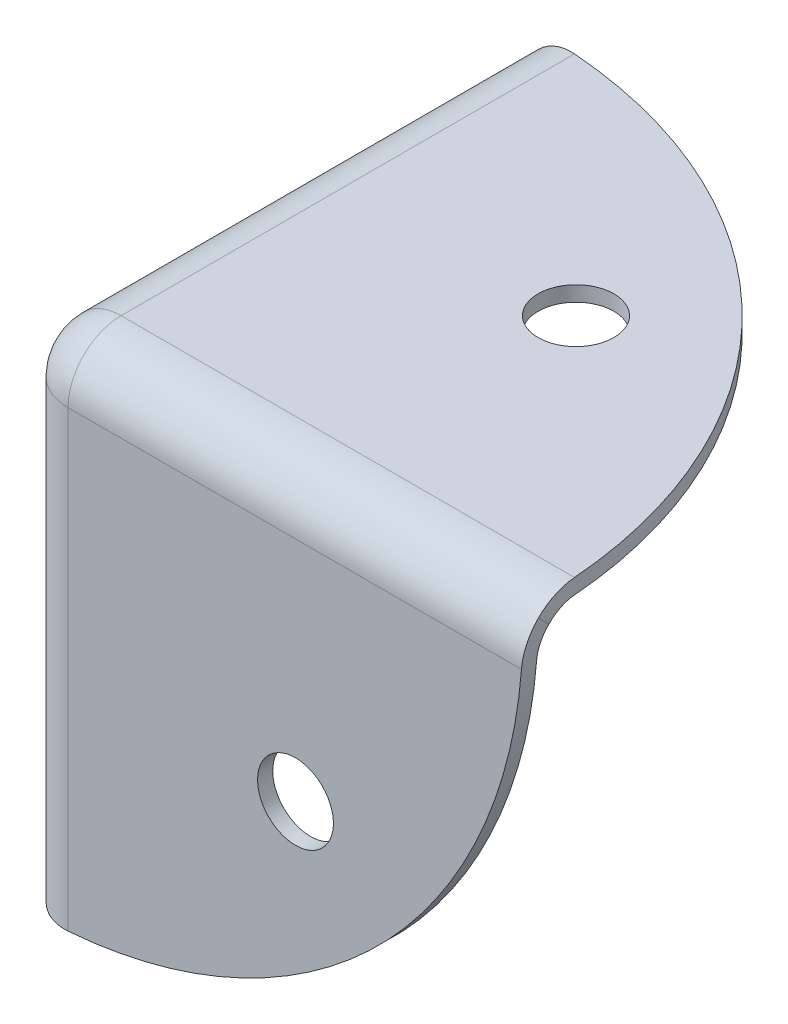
ISO-10303-21;
HEADER;
FILE_DESCRIPTION(('STEP AP214'),'2;1');
FILE_NAME('part.step','',(''),(''),'','','');
FILE_SCHEMA(('AUTOMOTIVE_DESIGN { 1 0 10303 214 1 1 1 1 }'));
ENDSEC;
DATA;
#1=APPLICATION_CONTEXT('core data for automotive mechanical design processes');
#2=APPLICATION_PROTOCOL_DEFINITION('international standard','automotive_design',2000,#1);
#3=PRODUCT_CONTEXT('',#1,'mechanical');
#4=PRODUCT('Part','Part','',(#3));
#5=PRODUCT_RELATED_PRODUCT_CATEGORY('part','',(#4));
#6=PRODUCT_DEFINITION_FORMATION('','',#4);
#7=PRODUCT_DEFINITION_CONTEXT('part definition',#1,'design');
#8=PRODUCT_DEFINITION('design','',#6,#7);
#9=PRODUCT_DEFINITION_SHAPE('','',#8);
#10=(LENGTH_UNIT() NAMED_UNIT(*) SI_UNIT(.MILLI.,.METRE.));
#11=(NAMED_UNIT(*) PLANE_ANGLE_UNIT() SI_UNIT($,.RADIAN.));
#12=(NAMED_UNIT(*) SI_UNIT($,.STERADIAN.) SOLID_ANGLE_UNIT());
#13=UNCERTAINTY_MEASURE_WITH_UNIT(LENGTH_MEASURE(1.E-05),#10,'distance_accuracy_value','');
#14=(GEOMETRIC_REPRESENTATION_CONTEXT(3) GLOBAL_UNCERTAINTY_ASSIGNED_CONTEXT((#13)) GLOBAL_UNIT_ASSIGNED_CONTEXT((#10,
#11,#12)) REPRESENTATION_CONTEXT('',''));
#15=CARTESIAN_POINT('',(0.,0.,0.));
#16=DIRECTION('',(0.,0.,1.));
#17=DIRECTION('',(1.,0.,0.));
#18=AXIS2_PLACEMENT_3D('',#15,#16,#17);
#19=CARTESIAN_POINT('',(0.,0.8,0.));
#20=DIRECTION('',(0.,1.,0.));
#21=DIRECTION('',(0.,0.,1.));
#22=AXIS2_PLACEMENT_3D('',#19,#20,#21);
#23=PLANE('',#22);
#24=DIRECTION('',(0.,0.,1.));
#25=VECTOR('',#24,1.);
#26=CARTESIAN_POINT('',(2.,0.8,0.8));
#27=LINE('',#26,#25);
#28=CARTESIAN_POINT('',(2.,0.8,-25.9229627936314));
#29=VERTEX_POINT('',#28);
#30=CARTESIAN_POINT('',(2.,0.8,-2.));
#31=VERTEX_POINT('',#30);
#32=EDGE_CURVE('E52',#29,#31,#27,.T.);
#33=ORIENTED_EDGE('',*,*,#32,.T.);
#34=DIRECTION('',(1.,0.,0.));
#35=VECTOR('',#34,1.);
#36=CARTESIAN_POINT('',(26.,0.8,-2.));
#37=LINE('',#36,#35);
#38=CARTESIAN_POINT('',(25.9229627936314,0.8,-2.));
#39=VERTEX_POINT('',#38);
#40=EDGE_CURVE('E234',#31,#39,#37,.T.);
#41=ORIENTED_EDGE('',*,*,#40,.T.);
#42=CARTESIAN_POINT('',(0.,0.8,0.));
#43=DIRECTION('',(0.,1.,0.));
#44=DIRECTION('',(0.,0.,1.));
#45=AXIS2_PLACEMENT_3D('',#42,#43,#44);
#46=CIRCLE('',#45,26.);
#47=EDGE_CURVE('E147',#39,#29,#46,.T.);
#48=ORIENTED_EDGE('',*,*,#47,.T.);
#49=EDGE_LOOP('',(#33,#41,#48));
#50=FACE_BOUND('',#49,.T.);
#51=CARTESIAN_POINT('',(14.,0.8,-14.));
#52=DIRECTION('',(0.,1.,0.));
#53=DIRECTION('',(0.,0.,1.));
#54=AXIS2_PLACEMENT_3D('',#51,#52,#53);
#55=CIRCLE('',#54,2.);
#56=CARTESIAN_POINT('',(14.,0.8,-16.));
#57=VERTEX_POINT('',#56);
#58=EDGE_CURVE('E148',#57,#57,#55,.T.);
#59=ORIENTED_EDGE('',*,*,#58,.F.);
#60=EDGE_LOOP('',(#59));
#61=FACE_BOUND('',#60,.T.);
#62=ADVANCED_FACE('F34',(#50,#61),#23,.T.);
#63=CARTESIAN_POINT('',(0.,0.,0.));
#64=DIRECTION('',(0.,1.,0.));
#65=DIRECTION('',(0.,0.,1.));
#66=AXIS2_PLACEMENT_3D('',#63,#64,#65);
#67=PLANE('',#66);
#68=CARTESIAN_POINT('',(0.,0.,0.));
#69=DIRECTION('',(0.,1.,0.));
#70=DIRECTION('',(0.,0.,1.));
#71=AXIS2_PLACEMENT_3D('',#68,#69,#70);
#72=CIRCLE('',#71,26.);
#73=CARTESIAN_POINT('',(25.9229627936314,0.,-2.));
#74=VERTEX_POINT('',#73);
#75=CARTESIAN_POINT('',(2.,0.,-25.9229627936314));
#76=VERTEX_POINT('',#75);
#77=EDGE_CURVE('E129',#74,#76,#72,.T.);
#78=ORIENTED_EDGE('',*,*,#77,.F.);
#79=DIRECTION('',(-1.,0.,0.));
#80=VECTOR('',#79,1.);
#81=CARTESIAN_POINT('',(0.,0.,-2.));
#82=LINE('',#81,#80);
#83=CARTESIAN_POINT('',(2.,0.,-2.));
#84=VERTEX_POINT('',#83);
#85=EDGE_CURVE('E144',#74,#84,#82,.T.);
#86=ORIENTED_EDGE('',*,*,#85,.T.);
#87=DIRECTION('',(0.,0.,1.));
#88=VECTOR('',#87,1.);
#89=CARTESIAN_POINT('',(2.,0.,0.));
#90=LINE('',#89,#88);
#91=EDGE_CURVE('E146',#84,#76,#90,.F.);
#92=ORIENTED_EDGE('',*,*,#91,.T.);
#93=EDGE_LOOP('',(#78,#86,#92));
#94=FACE_BOUND('',#93,.T.);
#95=CARTESIAN_POINT('',(14.,0.,-14.));
#96=DIRECTION('',(0.,1.,0.));
#97=DIRECTION('',(0.,0.,1.));
#98=AXIS2_PLACEMENT_3D('',#95,#96,#97);
#99=CIRCLE('',#98,2.);
#100=CARTESIAN_POINT('',(14.,0.,-16.));
#101=VERTEX_POINT('',#100);
#102=EDGE_CURVE('E329',#101,#101,#99,.T.);
#103=ORIENTED_EDGE('',*,*,#102,.T.);
#104=EDGE_LOOP('',(#103));
#105=FACE_BOUND('',#104,.T.);
#106=ADVANCED_FACE('F142',(#94,#105),#67,.F.);
#107=CARTESIAN_POINT('',(-0.8,0.8,0.8));
#108=DIRECTION('',(1.,0.,0.));
#109=DIRECTION('',(0.,0.,-1.));
#110=AXIS2_PLACEMENT_3D('',#107,#108,#109);
#111=PLANE('',#110);
#112=CARTESIAN_POINT('',(-0.800000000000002,0.,0.));
#113=DIRECTION('',(1.,0.,0.));
#114=DIRECTION('',(0.,0.,-1.));
#115=AXIS2_PLACEMENT_3D('',#112,#113,#114);
#116=CIRCLE('',#115,26.);
#117=CARTESIAN_POINT('',(-0.800000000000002,-2.,-25.9229627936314));
#118=VERTEX_POINT('',#117);
#119=CARTESIAN_POINT('',(-0.800000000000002,-25.9229627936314,-2.));
#120=VERTEX_POINT('',#119);
#121=EDGE_CURVE('E324',#118,#120,#116,.F.);
#122=ORIENTED_EDGE('',*,*,#121,.T.);
#123=DIRECTION('',(0.,-1.,0.));
#124=VECTOR('',#123,1.);
#125=CARTESIAN_POINT('',(-0.8,0.8,-2.));
#126=LINE('',#125,#124);
#127=CARTESIAN_POINT('',(-0.8,-2.,-2.));
#128=VERTEX_POINT('',#127);
#129=EDGE_CURVE('E341',#120,#128,#126,.F.);
#130=ORIENTED_EDGE('',*,*,#129,.T.);
#131=DIRECTION('',(0.,0.,1.));
#132=VECTOR('',#131,1.);
#133=CARTESIAN_POINT('',(-0.8,-2.,-26.));
#134=LINE('',#133,#132);
#135=EDGE_CURVE('E277',#128,#118,#134,.F.);
#136=ORIENTED_EDGE('',*,*,#135,.T.);
#137=EDGE_LOOP('',(#122,#130,#136));
#138=FACE_BOUND('',#137,.T.);
#139=CARTESIAN_POINT('',(-0.800000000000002,-14.,-14.));
#140=DIRECTION('',(1.,0.,0.));
#141=DIRECTION('',(0.,0.,-1.));
#142=AXIS2_PLACEMENT_3D('',#139,#140,#141);
#143=CIRCLE('',#142,2.);
#144=CARTESIAN_POINT('',(-0.800000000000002,-14.,-16.));
#145=VERTEX_POINT('',#144);
#146=EDGE_CURVE('E318',#145,#145,#143,.F.);
#147=ORIENTED_EDGE('',*,*,#146,.F.);
#148=EDGE_LOOP('',(#147));
#149=FACE_BOUND('',#148,.T.);
#150=ADVANCED_FACE('F185',(#138,#149),#111,.F.);
#151=CARTESIAN_POINT('',(-0.8,0.8,0.8));
#152=DIRECTION('',(0.,0.,-1.));
#153=DIRECTION('',(-1.,0.,0.));
#154=AXIS2_PLACEMENT_3D('',#151,#152,#153);
#155=PLANE('',#154);
#156=DIRECTION('',(1.,0.,0.));
#157=VECTOR('',#156,1.);
#158=CARTESIAN_POINT('',(-0.8,-2.,0.8));
#159=LINE('',#158,#157);
#160=CARTESIAN_POINT('',(25.9229627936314,-2.,0.800000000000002));
#161=VERTEX_POINT('',#160);
#162=CARTESIAN_POINT('',(2.,-2.,0.8));
#163=VERTEX_POINT('',#162);
#164=EDGE_CURVE('E365',#161,#163,#159,.F.);
#165=ORIENTED_EDGE('',*,*,#164,.T.);
#166=DIRECTION('',(0.,-1.,0.));
#167=VECTOR('',#166,1.);
#168=CARTESIAN_POINT('',(2.,0.8,0.8));
#169=LINE('',#168,#167);
#170=CARTESIAN_POINT('',(2.,-25.9229627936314,0.800000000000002));
#171=VERTEX_POINT('',#170);
#172=EDGE_CURVE('E256',#163,#171,#169,.T.);
#173=ORIENTED_EDGE('',*,*,#172,.T.);
#174=CARTESIAN_POINT('',(0.,0.,0.800000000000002));
#175=DIRECTION('',(0.,0.,-1.));
#176=DIRECTION('',(-1.,0.,0.));
#177=AXIS2_PLACEMENT_3D('',#174,#175,#176);
#178=CIRCLE('',#177,26.);
#179=EDGE_CURVE('E317',#161,#171,#178,.T.);
#180=ORIENTED_EDGE('',*,*,#179,.F.);
#181=EDGE_LOOP('',(#165,#173,#180));
#182=FACE_BOUND('',#181,.T.);
#183=CARTESIAN_POINT('',(14.,-14.,0.800000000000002));
#184=DIRECTION('',(0.,0.,-1.));
#185=DIRECTION('',(-1.,0.,0.));
#186=AXIS2_PLACEMENT_3D('',#183,#184,#185);
#187=CIRCLE('',#186,2.);
#188=CARTESIAN_POINT('',(12.,-14.,0.800000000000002));
#189=VERTEX_POINT('',#188);
#190=EDGE_CURVE('E313',#189,#189,#187,.T.);
#191=ORIENTED_EDGE('',*,*,#190,.T.);
#192=EDGE_LOOP('',(#191));
#193=FACE_BOUND('',#192,.T.);
#194=ADVANCED_FACE('F224',(#182,#193),#155,.F.);
#195=CARTESIAN_POINT('',(0.,0.8,0.));
#196=DIRECTION('',(0.,-1.,0.));
#197=DIRECTION('',(0.,0.,-1.));
#198=AXIS2_PLACEMENT_3D('',#195,#196,#197);
#199=CYLINDRICAL_SURFACE('',#198,26.);
#200=ORIENTED_EDGE('',*,*,#47,.F.);
#201=CARTESIAN_POINT('',(25.9229627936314,0.8,-2.));
#202=CARTESIAN_POINT('',(25.9289998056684,0.800007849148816,-1.92179588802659));
#203=CARTESIAN_POINT('',(25.934675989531,0.79672369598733,-1.84356634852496));
#204=CARTESIAN_POINT('',(25.9452895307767,0.783616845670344,-1.68760592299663));
#205=CARTESIAN_POINT('',(25.9502268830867,0.773794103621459,-1.60987504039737));
#206=CARTESIAN_POINT('',(25.9593483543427,0.747647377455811,-1.4554143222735));
#207=CARTESIAN_POINT('',(25.9635320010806,0.731319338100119,-1.3786851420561));
#208=CARTESIAN_POINT('',(25.9711497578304,0.692284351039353,-1.22685330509));
#209=CARTESIAN_POINT('',(25.9745839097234,0.669577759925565,-1.15175055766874));
#210=CARTESIAN_POINT('',(25.9837982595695,0.592057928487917,-0.929577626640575));
#211=CARTESIAN_POINT('',(25.9884912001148,0.527842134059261,-0.785628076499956));
#212=CARTESIAN_POINT('',(25.9953466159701,0.376283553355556,-0.510753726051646));
#213=CARTESIAN_POINT('',(25.9975141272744,0.288987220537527,-0.379803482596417));
#214=CARTESIAN_POINT('',(25.9991388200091,0.158479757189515,-0.215681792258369));
#215=CARTESIAN_POINT('',(25.9994404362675,0.124298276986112,-0.17512344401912));
#216=CARTESIAN_POINT('',(25.999852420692,0.0537340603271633,-0.0960636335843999));
#217=CARTESIAN_POINT('',(25.9999630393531,0.0173542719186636,-0.0575595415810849));
#218=CARTESIAN_POINT('',(25.9999922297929,-0.0201010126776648,-0.0201010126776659));
#219=B_SPLINE_CURVE_WITH_KNOTS('',3,(#201,#202,#203,#204,#205,#206,#207,#208,#209,#210,#211,
#212,#213,#214,#215,#216,#217,#218),.UNSPECIFIED.,.F.,.F.,(4,2,2,2,2,2,2,2,4),(0.,
0.235236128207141,0.470473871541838,0.705858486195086,0.941229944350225,1.41192869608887,
1.88168720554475,2.04074858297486,2.19960119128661),.UNSPECIFIED.);
#220=CARTESIAN_POINT('',(25.9999922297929,-0.0201010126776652,-0.0201010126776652));
#221=VERTEX_POINT('',#220);
#222=EDGE_CURVE('E12',#39,#221,#219,.T.);
#223=ORIENTED_EDGE('',*,*,#222,.T.);
#224=CARTESIAN_POINT('',(0.,0.,0.));
#225=DIRECTION('',(0.,-0.707106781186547,0.707106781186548));
#226=DIRECTION('',(0.,-0.707106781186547,-0.707106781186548));
#227=AXIS2_PLACEMENT_3D('',#224,#225,#226);
#228=ELLIPSE('',#227,36.7695526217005,26.);
#229=CARTESIAN_POINT('',(25.9934002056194,-0.585786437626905,-0.585786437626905));
#230=VERTEX_POINT('',#229);
#231=EDGE_CURVE('E132',#221,#230,#228,.F.);
#232=ORIENTED_EDGE('',*,*,#231,.T.);
#233=CARTESIAN_POINT('',(25.9934002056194,-0.585786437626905,-0.585786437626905));
#234=CARTESIAN_POINT('',(25.9925055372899,-0.546089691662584,-0.625484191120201));
#235=CARTESIAN_POINT('',(25.9914826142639,-0.508085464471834,-0.666832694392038));
#236=CARTESIAN_POINT('',(25.9891416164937,-0.435688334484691,-0.752570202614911));
#237=CARTESIAN_POINT('',(25.9878235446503,-0.401295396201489,-0.796959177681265));
#238=CARTESIAN_POINT('',(25.9833695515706,-0.303892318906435,-0.934267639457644));
#239=CARTESIAN_POINT('',(25.9797333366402,-0.246632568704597,-1.0313540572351));
#240=CARTESIAN_POINT('',(25.9709121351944,-0.149212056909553,-1.23369231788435));
#241=CARTESIAN_POINT('',(25.9657260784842,-0.109063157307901,-1.33894976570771));
#242=CARTESIAN_POINT('',(25.9537114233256,-0.0470415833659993,-1.55449278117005));
#243=CARTESIAN_POINT('',(25.9468861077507,-0.0251327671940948,-1.66476794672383));
#244=CARTESIAN_POINT('',(25.9367296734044,-0.00839377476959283,-1.8131370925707));
#245=CARTESIAN_POINT('',(25.9340925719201,-0.00524468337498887,-1.85047402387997));
#246=CARTESIAN_POINT('',(25.9286518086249,-0.00105030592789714,-1.92520410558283));
#247=CARTESIAN_POINT('',(25.9258483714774,-2.24581737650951E-06,-1.96259711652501));
#248=CARTESIAN_POINT('',(25.9229627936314,0.,-2.));
#249=B_SPLINE_CURVE_WITH_KNOTS('',3,(#233,#234,#235,#236,#237,#238,#239,#240,#241,#242,#243,
#244,#245,#246,#247,#248),.UNSPECIFIED.,.F.,.F.,(4,2,2,2,2,2,2,4),(0.,0.168337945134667,
0.336674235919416,0.673240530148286,1.01003976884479,1.34617005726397,1.45881386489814,
1.57130884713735),.UNSPECIFIED.);
#250=EDGE_CURVE('E125',#230,#74,#249,.T.);
#251=ORIENTED_EDGE('',*,*,#250,.T.);
#252=ORIENTED_EDGE('',*,*,#77,.T.);
#253=CARTESIAN_POINT('',(2.,0.,-25.9229627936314));
#254=CARTESIAN_POINT('',(1.94395472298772,-7.9071376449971E-07,-25.927287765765));
#255=CARTESIAN_POINT('',(1.88792228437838,-0.00235749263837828,-25.9314266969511));
#256=CARTESIAN_POINT('',(1.77622533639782,-0.0117670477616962,-25.9393167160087));
#257=CARTESIAN_POINT('',(1.72056083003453,-0.01881993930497,-25.9430678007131));
#258=CARTESIAN_POINT('',(1.55465309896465,-0.0469960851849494,-25.9537143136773));
#259=CARTESIAN_POINT('',(1.44547604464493,-0.0751368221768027,-25.9600045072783));
#260=CARTESIAN_POINT('',(1.23330511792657,-0.149365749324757,-25.9709509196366));
#261=CARTESIAN_POINT('',(1.13031609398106,-0.195467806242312,-25.9756058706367));
#262=CARTESIAN_POINT('',(0.933631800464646,-0.304288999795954,-25.9834175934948));
#263=CARTESIAN_POINT('',(0.839917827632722,-0.366973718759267,-25.9865774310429));
#264=CARTESIAN_POINT('',(0.723098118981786,-0.460221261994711,-25.9899593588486));
#265=CARTESIAN_POINT('',(0.694639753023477,-0.484273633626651,-25.9907339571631));
#266=CARTESIAN_POINT('',(0.639144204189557,-0.533899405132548,-25.9921576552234));
#267=CARTESIAN_POINT('',(0.612105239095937,-0.559470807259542,-25.9928069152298));
#268=CARTESIAN_POINT('',(0.585786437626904,-0.585786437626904,-25.9934002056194));
#269=B_SPLINE_CURVE_WITH_KNOTS('',3,(#253,#254,#255,#256,#257,#258,#259,#260,#261,#262,#263,
#264,#265,#266,#267,#268),.UNSPECIFIED.,.F.,.F.,(4,2,2,2,2,2,2,4),(0.,0.168531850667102,
0.337065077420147,0.674073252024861,1.01134212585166,1.34791640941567,1.45968220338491,
1.57130413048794),.UNSPECIFIED.);
#270=CARTESIAN_POINT('',(0.585786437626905,-0.585786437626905,-25.9934002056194));
#271=VERTEX_POINT('',#270);
#272=EDGE_CURVE('E210',#76,#271,#269,.T.);
#273=ORIENTED_EDGE('',*,*,#272,.T.);
#274=CARTESIAN_POINT('',(0.,0.,0.));
#275=DIRECTION('',(-0.707106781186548,-0.707106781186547,0.));
#276=DIRECTION('',(0.707106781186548,-0.707106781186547,0.));
#277=AXIS2_PLACEMENT_3D('',#274,#275,#276);
#278=ELLIPSE('',#277,36.7695526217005,26.);
#279=CARTESIAN_POINT('',(0.020101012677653,-0.020101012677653,-25.9999922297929));
#280=VERTEX_POINT('',#279);
#281=EDGE_CURVE('E366',#280,#271,#278,.T.);
#282=ORIENTED_EDGE('',*,*,#281,.F.);
#283=CARTESIAN_POINT('',(0.0201010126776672,-0.0201010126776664,-25.9999922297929));
#284=CARTESIAN_POINT('',(0.0755566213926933,0.0353655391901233,-25.9999502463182));
#285=CARTESIAN_POINT('',(0.133351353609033,0.0884887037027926,-25.9997273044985));
#286=CARTESIAN_POINT('',(0.253189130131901,0.18970137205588,-25.9988360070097));
#287=CARTESIAN_POINT('',(0.315232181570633,0.237790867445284,-25.9981676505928));
#288=CARTESIAN_POINT('',(0.443177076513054,0.328617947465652,-25.9963014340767));
#289=CARTESIAN_POINT('',(0.509081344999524,0.371352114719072,-25.9951032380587));
#290=CARTESIAN_POINT('',(0.644212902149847,0.45112301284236,-25.9921058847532));
#291=CARTESIAN_POINT('',(0.713440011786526,0.48816005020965,-25.9903067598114));
#292=CARTESIAN_POINT('',(0.925485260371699,0.590367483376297,-25.9839064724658));
#293=CARTESIAN_POINT('',(1.0726808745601,0.646643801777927,-25.9783022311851));
#294=CARTESIAN_POINT('',(1.37400742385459,0.733618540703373,-25.9641054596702));
#295=CARTESIAN_POINT('',(1.52812391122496,0.764367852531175,-25.9555189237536));
#296=CARTESIAN_POINT('',(1.73604519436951,0.788035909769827,-25.9420307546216));
#297=CARTESIAN_POINT('',(1.78878853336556,0.792524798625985,-25.938447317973));
#298=CARTESIAN_POINT('',(1.89435187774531,0.798503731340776,-25.9309509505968));
#299=CARTESIAN_POINT('',(1.94717169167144,0.799997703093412,-25.9270384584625));
#300=CARTESIAN_POINT('',(2.,0.800000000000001,-25.9229627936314));
#301=B_SPLINE_CURVE_WITH_KNOTS('',3,(#283,#284,#285,#286,#287,#288,#289,#290,#291,#292,#293,
#294,#295,#296,#297,#298,#299,#300),.UNSPECIFIED.,.F.,.F.,(4,2,2,2,2,2,2,2,4),(0.,
0.235226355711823,0.470453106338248,0.705829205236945,0.941192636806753,1.41187030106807,
1.88160734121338,2.04070858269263,2.19960102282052),.UNSPECIFIED.);
#302=EDGE_CURVE('E44',#280,#29,#301,.T.);
#303=ORIENTED_EDGE('',*,*,#302,.T.);
#304=EDGE_LOOP('',(#200,#223,#232,#251,#252,#273,#282,#303));
#305=FACE_BOUND('',#304,.T.);
#306=ADVANCED_FACE('F127',(#305),#199,.T.);
#307=CARTESIAN_POINT('',(14.,0.8,-14.));
#308=DIRECTION('',(0.,-1.,0.));
#309=DIRECTION('',(0.,0.,-1.));
#310=AXIS2_PLACEMENT_3D('',#307,#308,#309);
#311=CYLINDRICAL_SURFACE('',#310,2.);
#312=CARTESIAN_POINT('',(14.,0.8,-16.));
#313=CARTESIAN_POINT('',(14.,0.791666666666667,-16.));
#314=CARTESIAN_POINT('',(14.,0.783333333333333,-16.));
#315=CARTESIAN_POINT('',(14.,0.766666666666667,-16.));
#316=CARTESIAN_POINT('',(14.,0.758333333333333,-16.));
#317=CARTESIAN_POINT('',(14.,0.741666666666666,-16.));
#318=CARTESIAN_POINT('',(14.,0.733333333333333,-16.));
#319=CARTESIAN_POINT('',(14.,0.716666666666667,-16.));
#320=CARTESIAN_POINT('',(14.,0.708333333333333,-16.));
#321=CARTESIAN_POINT('',(14.,0.691666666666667,-16.));
#322=CARTESIAN_POINT('',(14.,0.683333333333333,-16.));
#323=CARTESIAN_POINT('',(14.,0.666666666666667,-16.));
#324=CARTESIAN_POINT('',(14.,0.658333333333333,-16.));
#325=CARTESIAN_POINT('',(14.,0.641666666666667,-16.));
#326=CARTESIAN_POINT('',(14.,0.633333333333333,-16.));
#327=CARTESIAN_POINT('',(14.,0.616666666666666,-16.));
#328=CARTESIAN_POINT('',(14.,0.608333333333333,-16.));
#329=CARTESIAN_POINT('',(14.,0.591666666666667,-16.));
#330=CARTESIAN_POINT('',(14.,0.583333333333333,-16.));
#331=CARTESIAN_POINT('',(14.,0.566666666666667,-16.));
#332=CARTESIAN_POINT('',(14.,0.558333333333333,-16.));
#333=CARTESIAN_POINT('',(14.,0.541666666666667,-16.));
#334=CARTESIAN_POINT('',(14.,0.533333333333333,-16.));
#335=CARTESIAN_POINT('',(14.,0.516666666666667,-16.));
#336=CARTESIAN_POINT('',(14.,0.508333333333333,-16.));
#337=CARTESIAN_POINT('',(14.,0.491666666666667,-16.));
#338=CARTESIAN_POINT('',(14.,0.483333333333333,-16.));
#339=CARTESIAN_POINT('',(14.,0.466666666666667,-16.));
#340=CARTESIAN_POINT('',(14.,0.458333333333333,-16.));
#341=CARTESIAN_POINT('',(14.,0.441666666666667,-16.));
#342=CARTESIAN_POINT('',(14.,0.433333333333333,-16.));
#343=CARTESIAN_POINT('',(14.,0.416666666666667,-16.));
#344=CARTESIAN_POINT('',(14.,0.408333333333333,-16.));
#345=CARTESIAN_POINT('',(14.,0.391666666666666,-16.));
#346=CARTESIAN_POINT('',(14.,0.383333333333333,-16.));
#347=CARTESIAN_POINT('',(14.,0.366666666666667,-16.));
#348=CARTESIAN_POINT('',(14.,0.358333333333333,-16.));
#349=CARTESIAN_POINT('',(14.,0.341666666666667,-16.));
#350=CARTESIAN_POINT('',(14.,0.333333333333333,-16.));
#351=CARTESIAN_POINT('',(14.,0.316666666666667,-16.));
#352=CARTESIAN_POINT('',(14.,0.308333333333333,-16.));
#353=CARTESIAN_POINT('',(14.,0.291666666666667,-16.));
#354=CARTESIAN_POINT('',(14.,0.283333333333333,-16.));
#355=CARTESIAN_POINT('',(14.,0.266666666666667,-16.));
#356=CARTESIAN_POINT('',(14.,0.258333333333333,-16.));
#357=CARTESIAN_POINT('',(14.,0.241666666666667,-16.));
#358=CARTESIAN_POINT('',(14.,0.233333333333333,-16.));
#359=CARTESIAN_POINT('',(14.,0.216666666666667,-16.));
#360=CARTESIAN_POINT('',(14.,0.208333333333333,-16.));
#361=CARTESIAN_POINT('',(14.,0.191666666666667,-16.));
#362=CARTESIAN_POINT('',(14.,0.183333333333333,-16.));
#363=CARTESIAN_POINT('',(14.,0.166666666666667,-16.));
#364=CARTESIAN_POINT('',(14.,0.158333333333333,-16.));
#365=CARTESIAN_POINT('',(14.,0.141666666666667,-16.));
#366=CARTESIAN_POINT('',(14.,0.133333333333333,-16.));
#367=CARTESIAN_POINT('',(14.,0.116666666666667,-16.));
#368=CARTESIAN_POINT('',(14.,0.108333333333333,-16.));
#369=CARTESIAN_POINT('',(14.,0.0916666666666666,-16.));
#370=CARTESIAN_POINT('',(14.,0.0833333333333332,-16.));
#371=CARTESIAN_POINT('',(14.,0.0666666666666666,-16.));
#372=CARTESIAN_POINT('',(14.,0.0583333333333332,-16.));
#373=CARTESIAN_POINT('',(14.,0.0416666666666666,-16.));
#374=CARTESIAN_POINT('',(14.,0.0333333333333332,-16.));
#375=CARTESIAN_POINT('',(14.,0.0166666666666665,-16.));
#376=CARTESIAN_POINT('',(14.,0.00833333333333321,-16.));
#377=CARTESIAN_POINT('',(14.,0.,-16.));
#378=B_SPLINE_CURVE_WITH_KNOTS('',3,(#312,#313,#314,#315,#316,#317,#318,#319,#320,#321,#322,
#323,#324,#325,#326,#327,#328,#329,#330,#331,#332,#333,#334,#335,#336,#337,#338,#339,#340,#341,
#342,#343,#344,#345,#346,#347,#348,#349,#350,#351,#352,#353,#354,#355,#356,#357,#358,#359,#360,
#361,#362,#363,#364,#365,#366,#367,#368,#369,#370,#371,#372,#373,#374,#375,#376,#377),
.UNSPECIFIED.,.F.,.F.,(4,2,2,2,2,2,2,2,2,2,2,2,2,2,2,2,2,2,2,2,2,2,2,2,2,2,2,2,2,2,2,2,4),(0.,
0.0250000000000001,0.05,0.0750000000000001,0.1,0.125,0.15,0.175,0.2,0.225,0.25,0.275,0.3,0.325,
0.35,0.375,0.4,0.425,0.45,0.475,0.5,0.525,0.55,0.575,0.6,0.625,0.65,0.675,0.7,0.725,0.75,0.775,
0.8),.UNSPECIFIED.);
#379=EDGE_CURVE('BSEAM223',#57,#101,#378,.T.);
#380=ORIENTED_EDGE('',*,*,#58,.T.);
#381=ORIENTED_EDGE('',*,*,#102,.F.);
#382=ORIENTED_EDGE('',*,*,#379,.T.);
#383=ORIENTED_EDGE('',*,*,#379,.F.);
#384=EDGE_LOOP('',(#380,#382,#381,#383));
#385=FACE_BOUND('',#384,.T.);
#386=ADVANCED_FACE('F223',(#385),#311,.F.);
#387=CARTESIAN_POINT('',(0.,0.,0.));
#388=DIRECTION('',(0.,0.,1.));
#389=DIRECTION('',(1.,0.,0.));
#390=AXIS2_PLACEMENT_3D('',#387,#388,#389);
#391=PLANE('',#390);
#392=DIRECTION('',(0.,-1.,0.));
#393=VECTOR('',#392,1.);
#394=CARTESIAN_POINT('',(2.,0.,0.));
#395=LINE('',#394,#393);
#396=CARTESIAN_POINT('',(2.,-25.9229627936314,0.));
#397=VERTEX_POINT('',#396);
#398=CARTESIAN_POINT('',(2.,-2.,0.));
#399=VERTEX_POINT('',#398);
#400=EDGE_CURVE('E155',#397,#399,#395,.F.);
#401=ORIENTED_EDGE('',*,*,#400,.T.);
#402=DIRECTION('',(-1.,0.,0.));
#403=VECTOR('',#402,1.);
#404=CARTESIAN_POINT('',(26.,-2.,0.));
#405=LINE('',#404,#403);
#406=CARTESIAN_POINT('',(25.9229627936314,-2.,0.));
#407=VERTEX_POINT('',#406);
#408=EDGE_CURVE('E157',#399,#407,#405,.F.);
#409=ORIENTED_EDGE('',*,*,#408,.T.);
#410=CARTESIAN_POINT('',(0.,0.,0.));
#411=DIRECTION('',(0.,0.,1.));
#412=DIRECTION('',(1.,0.,0.));
#413=AXIS2_PLACEMENT_3D('',#410,#411,#412);
#414=CIRCLE('',#413,26.);
#415=EDGE_CURVE('E321',#397,#407,#414,.T.);
#416=ORIENTED_EDGE('',*,*,#415,.F.);
#417=EDGE_LOOP('',(#401,#409,#416));
#418=FACE_BOUND('',#417,.T.);
#419=CARTESIAN_POINT('',(14.,-14.,0.));
#420=DIRECTION('',(0.,0.,1.));
#421=DIRECTION('',(1.,0.,0.));
#422=AXIS2_PLACEMENT_3D('',#419,#420,#421);
#423=CIRCLE('',#422,2.);
#424=CARTESIAN_POINT('',(16.,-14.,0.));
#425=VERTEX_POINT('',#424);
#426=EDGE_CURVE('E316',#425,#425,#423,.T.);
#427=ORIENTED_EDGE('',*,*,#426,.T.);
#428=EDGE_LOOP('',(#427));
#429=FACE_BOUND('',#428,.T.);
#430=ADVANCED_FACE('F287',(#418,#429),#391,.F.);
#431=CARTESIAN_POINT('',(0.,0.,38.1395232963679));
#432=DIRECTION('',(0.,0.,-1.));
#433=DIRECTION('',(-1.,0.,0.));
#434=AXIS2_PLACEMENT_3D('',#431,#432,#433);
#435=CYLINDRICAL_SURFACE('',#434,26.);
#436=ORIENTED_EDGE('',*,*,#179,.T.);
#437=CARTESIAN_POINT('',(2.,-25.9229627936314,0.8));
#438=CARTESIAN_POINT('',(1.92179588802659,-25.9289998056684,0.800007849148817));
#439=CARTESIAN_POINT('',(1.84356634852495,-25.934675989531,0.796723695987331));
#440=CARTESIAN_POINT('',(1.68760592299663,-25.9452895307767,0.783616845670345));
#441=CARTESIAN_POINT('',(1.60987504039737,-25.9502268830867,0.77379410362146));
#442=CARTESIAN_POINT('',(1.4554143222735,-25.9593483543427,0.747647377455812));
#443=CARTESIAN_POINT('',(1.3786851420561,-25.9635320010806,0.73131933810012));
#444=CARTESIAN_POINT('',(1.22685330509,-25.9711497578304,0.692284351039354));
#445=CARTESIAN_POINT('',(1.15175055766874,-25.9745839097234,0.669577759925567));
#446=CARTESIAN_POINT('',(0.929577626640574,-25.9837982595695,0.592057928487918));
#447=CARTESIAN_POINT('',(0.785628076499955,-25.9884912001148,0.527842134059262));
#448=CARTESIAN_POINT('',(0.510753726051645,-25.9953466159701,0.376283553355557));
#449=CARTESIAN_POINT('',(0.379803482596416,-25.9975141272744,0.288987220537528));
#450=CARTESIAN_POINT('',(0.215681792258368,-25.9991388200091,0.158479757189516));
#451=CARTESIAN_POINT('',(0.175123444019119,-25.9994404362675,0.124298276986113));
#452=CARTESIAN_POINT('',(0.0960636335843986,-25.999852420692,0.0537340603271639));
#453=CARTESIAN_POINT('',(0.0575595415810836,-25.9999630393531,0.0173542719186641));
#454=CARTESIAN_POINT('',(0.0201010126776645,-25.9999922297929,-0.0201010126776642));
#455=B_SPLINE_CURVE_WITH_KNOTS('',3,(#437,#438,#439,#440,#441,#442,#443,#444,#445,#446,#447,
#448,#449,#450,#451,#452,#453,#454),.UNSPECIFIED.,.F.,.F.,(4,2,2,2,2,2,2,2,4),(0.,
0.23523612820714,0.470473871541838,0.705858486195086,0.941229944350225,1.41192869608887,
1.88168720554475,2.04074858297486,2.19960119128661),.UNSPECIFIED.);
#456=CARTESIAN_POINT('',(0.020101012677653,-25.9999922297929,-0.020101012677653));
#457=VERTEX_POINT('',#456);
#458=EDGE_CURVE('E255',#171,#457,#455,.T.);
#459=ORIENTED_EDGE('',*,*,#458,.T.);
#460=CARTESIAN_POINT('',(0.,0.,0.));
#461=DIRECTION('',(0.707106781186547,0.,0.707106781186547));
#462=DIRECTION('',(0.707106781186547,0.,-0.707106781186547));
#463=AXIS2_PLACEMENT_3D('',#460,#461,#462);
#464=ELLIPSE('',#463,36.7695526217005,26.);
#465=CARTESIAN_POINT('',(0.585786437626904,-25.9934002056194,-0.585786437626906));
#466=VERTEX_POINT('',#465);
#467=EDGE_CURVE('E372',#457,#466,#464,.T.);
#468=ORIENTED_EDGE('',*,*,#467,.T.);
#469=CARTESIAN_POINT('',(0.585786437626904,-25.9934002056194,-0.585786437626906));
#470=CARTESIAN_POINT('',(0.6254841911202,-25.9925055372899,-0.546089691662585));
#471=CARTESIAN_POINT('',(0.666832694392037,-25.9914826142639,-0.508085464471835));
#472=CARTESIAN_POINT('',(0.75257020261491,-25.9891416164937,-0.435688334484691));
#473=CARTESIAN_POINT('',(0.796959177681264,-25.9878235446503,-0.401295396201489));
#474=CARTESIAN_POINT('',(0.934267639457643,-25.9833695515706,-0.303892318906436));
#475=CARTESIAN_POINT('',(1.0313540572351,-25.9797333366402,-0.246632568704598));
#476=CARTESIAN_POINT('',(1.23369231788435,-25.9709121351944,-0.149212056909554));
#477=CARTESIAN_POINT('',(1.33894976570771,-25.9657260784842,-0.109063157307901));
#478=CARTESIAN_POINT('',(1.55449278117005,-25.9537114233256,-0.0470415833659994));
#479=CARTESIAN_POINT('',(1.66476794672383,-25.9468861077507,-0.0251327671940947));
#480=CARTESIAN_POINT('',(1.81313709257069,-25.9367296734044,-0.0083937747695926));
#481=CARTESIAN_POINT('',(1.85047402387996,-25.9340925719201,-0.00524468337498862));
#482=CARTESIAN_POINT('',(1.92520410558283,-25.9286518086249,-0.00105030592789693));
#483=CARTESIAN_POINT('',(1.96259711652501,-25.9258483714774,-2.24581737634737E-06));
#484=CARTESIAN_POINT('',(2.,-25.9229627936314,0.));
#485=B_SPLINE_CURVE_WITH_KNOTS('',3,(#469,#470,#471,#472,#473,#474,#475,#476,#477,#478,#479,
#480,#481,#482,#483,#484),.UNSPECIFIED.,.F.,.F.,(4,2,2,2,2,2,2,4),(0.,0.168337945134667,
0.336674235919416,0.673240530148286,1.01003976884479,1.34617005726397,1.45881386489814,
1.57130884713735),.UNSPECIFIED.);
#486=EDGE_CURVE('E205',#466,#397,#485,.T.);
#487=ORIENTED_EDGE('',*,*,#486,.T.);
#488=ORIENTED_EDGE('',*,*,#415,.T.);
#489=CARTESIAN_POINT('',(25.9229627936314,-2.,0.));
#490=CARTESIAN_POINT('',(25.927287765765,-1.94395472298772,-7.90713764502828E-07));
#491=CARTESIAN_POINT('',(25.9314266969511,-1.88792228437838,-0.00235749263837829));
#492=CARTESIAN_POINT('',(25.9393167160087,-1.77622533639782,-0.0117670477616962));
#493=CARTESIAN_POINT('',(25.9430678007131,-1.72056083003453,-0.01881993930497));
#494=CARTESIAN_POINT('',(25.9537143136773,-1.55465309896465,-0.0469960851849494));
#495=CARTESIAN_POINT('',(25.9600045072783,-1.44547604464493,-0.0751368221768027));
#496=CARTESIAN_POINT('',(25.9709509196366,-1.23330511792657,-0.149365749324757));
#497=CARTESIAN_POINT('',(25.9756058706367,-1.13031609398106,-0.195467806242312));
#498=CARTESIAN_POINT('',(25.9834175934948,-0.933631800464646,-0.304288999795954));
#499=CARTESIAN_POINT('',(25.9865774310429,-0.839917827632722,-0.366973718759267));
#500=CARTESIAN_POINT('',(25.9899593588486,-0.723098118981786,-0.460221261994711));
#501=CARTESIAN_POINT('',(25.9907339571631,-0.694639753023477,-0.484273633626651));
#502=CARTESIAN_POINT('',(25.9921576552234,-0.639144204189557,-0.533899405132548));
#503=CARTESIAN_POINT('',(25.9928069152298,-0.612105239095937,-0.559470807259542));
#504=CARTESIAN_POINT('',(25.9934002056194,-0.585786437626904,-0.585786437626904));
#505=B_SPLINE_CURVE_WITH_KNOTS('',3,(#489,#490,#491,#492,#493,#494,#495,#496,#497,#498,#499,
#500,#501,#502,#503,#504),.UNSPECIFIED.,.F.,.F.,(4,2,2,2,2,2,2,4),(0.,0.168531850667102,
0.337065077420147,0.674073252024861,1.01134212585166,1.34791640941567,1.45968220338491,
1.57130413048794),.UNSPECIFIED.);
#506=EDGE_CURVE('E138',#407,#230,#505,.T.);
#507=ORIENTED_EDGE('',*,*,#506,.T.);
#508=ORIENTED_EDGE('',*,*,#231,.F.);
#509=CARTESIAN_POINT('',(25.9999922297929,-0.0201010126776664,-0.0201010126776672));
#510=CARTESIAN_POINT('',(25.9999502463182,-0.0755566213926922,0.0353655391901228));
#511=CARTESIAN_POINT('',(25.9997273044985,-0.133351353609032,0.088488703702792));
#512=CARTESIAN_POINT('',(25.9988360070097,-0.2531891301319,0.189701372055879));
#513=CARTESIAN_POINT('',(25.9981676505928,-0.315232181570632,0.237790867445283));
#514=CARTESIAN_POINT('',(25.9963014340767,-0.443177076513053,0.328617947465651));
#515=CARTESIAN_POINT('',(25.9951032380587,-0.509081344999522,0.371352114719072));
#516=CARTESIAN_POINT('',(25.9921058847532,-0.644212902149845,0.451123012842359));
#517=CARTESIAN_POINT('',(25.9903067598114,-0.713440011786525,0.488160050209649));
#518=CARTESIAN_POINT('',(25.9839064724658,-0.925485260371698,0.590367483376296));
#519=CARTESIAN_POINT('',(25.9783022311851,-1.0726808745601,0.646643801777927));
#520=CARTESIAN_POINT('',(25.9641054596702,-1.37400742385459,0.733618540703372));
#521=CARTESIAN_POINT('',(25.9555189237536,-1.52812391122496,0.764367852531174));
#522=CARTESIAN_POINT('',(25.9420307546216,-1.73604519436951,0.788035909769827));
#523=CARTESIAN_POINT('',(25.938447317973,-1.78878853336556,0.792524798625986));
#524=CARTESIAN_POINT('',(25.9309509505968,-1.8943518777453,0.798503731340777));
#525=CARTESIAN_POINT('',(25.9270384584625,-1.94717169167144,0.799997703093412));
#526=CARTESIAN_POINT('',(25.9229627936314,-2.,0.800000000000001));
#527=B_SPLINE_CURVE_WITH_KNOTS('',3,(#509,#510,#511,#512,#513,#514,#515,#516,#517,#518,#519,
#520,#521,#522,#523,#524,#525,#526),.UNSPECIFIED.,.F.,.F.,(4,2,2,2,2,2,2,2,4),(0.,
0.235226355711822,0.470453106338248,0.705829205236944,0.941192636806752,1.41187030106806,
1.88160734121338,2.04070858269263,2.19960102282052),.UNSPECIFIED.);
#528=EDGE_CURVE('E249',#221,#161,#527,.T.);
#529=ORIENTED_EDGE('',*,*,#528,.T.);
#530=EDGE_LOOP('',(#436,#459,#468,#487,#488,#507,#508,#529));
#531=FACE_BOUND('',#530,.T.);
#532=ADVANCED_FACE('F176',(#531),#435,.T.);
#533=CARTESIAN_POINT('',(14.,-14.,38.1395232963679));
#534=DIRECTION('',(0.,0.,-1.));
#535=DIRECTION('',(-1.,0.,0.));
#536=AXIS2_PLACEMENT_3D('',#533,#534,#535);
#537=CYLINDRICAL_SURFACE('',#536,2.);
#538=ORIENTED_EDGE('',*,*,#190,.F.);
#539=EDGE_LOOP('',(#538));
#540=FACE_BOUND('',#539,.T.);
#541=ORIENTED_EDGE('',*,*,#426,.F.);
#542=EDGE_LOOP('',(#541));
#543=FACE_BOUND('',#542,.T.);
#544=ADVANCED_FACE('F284',(#540,#543),#537,.F.);
#545=CARTESIAN_POINT('',(-37.5695526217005,0.,0.));
#546=DIRECTION('',(1.,0.,0.));
#547=DIRECTION('',(0.,0.,-1.));
#548=AXIS2_PLACEMENT_3D('',#545,#546,#547);
#549=CYLINDRICAL_SURFACE('',#548,26.);
#550=ORIENTED_EDGE('',*,*,#467,.F.);
#551=CARTESIAN_POINT('',(0.020101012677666,-25.9999922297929,-0.020101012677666));
#552=CARTESIAN_POINT('',(-0.0353655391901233,-25.9999502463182,-0.0755566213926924));
#553=CARTESIAN_POINT('',(-0.0884887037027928,-25.9997273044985,-0.133351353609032));
#554=CARTESIAN_POINT('',(-0.189701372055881,-25.9988360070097,-0.2531891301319));
#555=CARTESIAN_POINT('',(-0.237790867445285,-25.9981676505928,-0.315232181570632));
#556=CARTESIAN_POINT('',(-0.328617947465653,-25.9963014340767,-0.443177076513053));
#557=CARTESIAN_POINT('',(-0.371352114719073,-25.9951032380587,-0.509081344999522));
#558=CARTESIAN_POINT('',(-0.45112301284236,-25.9921058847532,-0.644212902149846));
#559=CARTESIAN_POINT('',(-0.488160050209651,-25.9903067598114,-0.713440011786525));
#560=CARTESIAN_POINT('',(-0.590367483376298,-25.9839064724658,-0.925485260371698));
#561=CARTESIAN_POINT('',(-0.646643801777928,-25.9783022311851,-1.0726808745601));
#562=CARTESIAN_POINT('',(-0.733618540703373,-25.9641054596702,-1.37400742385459));
#563=CARTESIAN_POINT('',(-0.764367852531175,-25.9555189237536,-1.52812391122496));
#564=CARTESIAN_POINT('',(-0.788035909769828,-25.9420307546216,-1.73604519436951));
#565=CARTESIAN_POINT('',(-0.792524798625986,-25.938447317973,-1.78878853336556));
#566=CARTESIAN_POINT('',(-0.798503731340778,-25.9309509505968,-1.8943518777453));
#567=CARTESIAN_POINT('',(-0.799997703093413,-25.9270384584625,-1.94717169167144));
#568=CARTESIAN_POINT('',(-0.800000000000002,-25.9229627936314,-2.));
#569=B_SPLINE_CURVE_WITH_KNOTS('',3,(#551,#552,#553,#554,#555,#556,#557,#558,#559,#560,#561,
#562,#563,#564,#565,#566,#567,#568),.UNSPECIFIED.,.F.,.F.,(4,2,2,2,2,2,2,2,4),(0.,
0.235226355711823,0.470453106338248,0.705829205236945,0.941192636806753,1.41187030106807,
1.88160734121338,2.04070858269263,2.19960102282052),.UNSPECIFIED.);
#570=EDGE_CURVE('E272',#457,#120,#569,.T.);
#571=ORIENTED_EDGE('',*,*,#570,.T.);
#572=ORIENTED_EDGE('',*,*,#121,.F.);
#573=CARTESIAN_POINT('',(-0.8,-2.,-25.9229627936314));
#574=CARTESIAN_POINT('',(-0.800007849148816,-1.92179588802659,-25.9289998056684));
#575=CARTESIAN_POINT('',(-0.79672369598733,-1.84356634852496,-25.934675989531));
#576=CARTESIAN_POINT('',(-0.783616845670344,-1.68760592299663,-25.9452895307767));
#577=CARTESIAN_POINT('',(-0.77379410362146,-1.60987504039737,-25.9502268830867));
#578=CARTESIAN_POINT('',(-0.747647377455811,-1.4554143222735,-25.9593483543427));
#579=CARTESIAN_POINT('',(-0.731319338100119,-1.3786851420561,-25.9635320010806));
#580=CARTESIAN_POINT('',(-0.692284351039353,-1.22685330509,-25.9711497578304));
#581=CARTESIAN_POINT('',(-0.669577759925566,-1.15175055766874,-25.9745839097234));
#582=CARTESIAN_POINT('',(-0.592057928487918,-0.929577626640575,-25.9837982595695));
#583=CARTESIAN_POINT('',(-0.527842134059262,-0.785628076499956,-25.9884912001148));
#584=CARTESIAN_POINT('',(-0.376283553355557,-0.510753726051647,-25.9953466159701));
#585=CARTESIAN_POINT('',(-0.288987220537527,-0.379803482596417,-25.9975141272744));
#586=CARTESIAN_POINT('',(-0.158479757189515,-0.215681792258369,-25.9991388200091));
#587=CARTESIAN_POINT('',(-0.124298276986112,-0.17512344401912,-25.9994404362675));
#588=CARTESIAN_POINT('',(-0.053734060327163,-0.0960636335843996,-25.999852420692));
#589=CARTESIAN_POINT('',(-0.017354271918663,-0.0575595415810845,-25.9999630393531));
#590=CARTESIAN_POINT('',(0.0201010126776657,-0.0201010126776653,-25.9999922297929));
#591=B_SPLINE_CURVE_WITH_KNOTS('',3,(#573,#574,#575,#576,#577,#578,#579,#580,#581,#582,#583,
#584,#585,#586,#587,#588,#589,#590),.UNSPECIFIED.,.F.,.F.,(4,2,2,2,2,2,2,2,4),(0.,
0.23523612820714,0.470473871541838,0.705858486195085,0.941229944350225,1.41192869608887,
1.88168720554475,2.04074858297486,2.19960119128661),.UNSPECIFIED.);
#592=EDGE_CURVE('E262',#118,#280,#591,.T.);
#593=ORIENTED_EDGE('',*,*,#592,.T.);
#594=ORIENTED_EDGE('',*,*,#281,.T.);
#595=CARTESIAN_POINT('',(0.585786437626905,-0.585786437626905,-25.9934002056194));
#596=CARTESIAN_POINT('',(0.546089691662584,-0.625484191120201,-25.9925055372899));
#597=CARTESIAN_POINT('',(0.508085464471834,-0.666832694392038,-25.9914826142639));
#598=CARTESIAN_POINT('',(0.435688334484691,-0.752570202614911,-25.9891416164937));
#599=CARTESIAN_POINT('',(0.401295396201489,-0.796959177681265,-25.9878235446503));
#600=CARTESIAN_POINT('',(0.303892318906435,-0.934267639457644,-25.9833695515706));
#601=CARTESIAN_POINT('',(0.246632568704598,-1.0313540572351,-25.9797333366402));
#602=CARTESIAN_POINT('',(0.149212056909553,-1.23369231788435,-25.9709121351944));
#603=CARTESIAN_POINT('',(0.109063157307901,-1.33894976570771,-25.9657260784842));
#604=CARTESIAN_POINT('',(0.0470415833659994,-1.55449278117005,-25.9537114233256));
#605=CARTESIAN_POINT('',(0.0251327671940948,-1.66476794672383,-25.9468861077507));
#606=CARTESIAN_POINT('',(0.00839377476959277,-1.81313709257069,-25.9367296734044));
#607=CARTESIAN_POINT('',(0.00524468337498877,-1.85047402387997,-25.9340925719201));
#608=CARTESIAN_POINT('',(0.00105030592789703,-1.92520410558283,-25.9286518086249));
#609=CARTESIAN_POINT('',(2.24581737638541E-06,-1.96259711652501,-25.9258483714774));
#610=CARTESIAN_POINT('',(0.,-2.,-25.9229627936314));
#611=B_SPLINE_CURVE_WITH_KNOTS('',3,(#595,#596,#597,#598,#599,#600,#601,#602,#603,#604,#605,
#606,#607,#608,#609,#610),.UNSPECIFIED.,.F.,.F.,(4,2,2,2,2,2,2,4),(0.,0.168337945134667,
0.336674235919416,0.673240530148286,1.01003976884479,1.34617005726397,1.45881386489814,
1.57130884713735),.UNSPECIFIED.);
#612=CARTESIAN_POINT('',(0.,-2.,-25.9229627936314));
#613=VERTEX_POINT('',#612);
#614=EDGE_CURVE('E215',#271,#613,#611,.T.);
#615=ORIENTED_EDGE('',*,*,#614,.T.);
#616=CARTESIAN_POINT('',(0.,0.,0.));
#617=DIRECTION('',(1.,0.,0.));
#618=DIRECTION('',(0.,0.,-1.));
#619=AXIS2_PLACEMENT_3D('',#616,#617,#618);
#620=CIRCLE('',#619,26.);
#621=CARTESIAN_POINT('',(0.,-25.9229627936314,-2.));
#622=VERTEX_POINT('',#621);
#623=EDGE_CURVE('E349',#622,#613,#620,.T.);
#624=ORIENTED_EDGE('',*,*,#623,.F.);
#625=CARTESIAN_POINT('',(0.,-25.9229627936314,-2.));
#626=CARTESIAN_POINT('',(7.90713764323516E-07,-25.927287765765,-1.94395472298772));
#627=CARTESIAN_POINT('',(0.00235749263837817,-25.9314266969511,-1.88792228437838));
#628=CARTESIAN_POINT('',(0.0117670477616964,-25.9393167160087,-1.77622533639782));
#629=CARTESIAN_POINT('',(0.0188199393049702,-25.9430678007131,-1.72056083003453));
#630=CARTESIAN_POINT('',(0.0469960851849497,-25.9537143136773,-1.55465309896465));
#631=CARTESIAN_POINT('',(0.0751368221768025,-25.9600045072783,-1.44547604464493));
#632=CARTESIAN_POINT('',(0.149365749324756,-25.9709509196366,-1.23330511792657));
#633=CARTESIAN_POINT('',(0.195467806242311,-25.9756058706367,-1.13031609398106));
#634=CARTESIAN_POINT('',(0.304288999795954,-25.9834175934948,-0.933631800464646));
#635=CARTESIAN_POINT('',(0.366973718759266,-25.9865774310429,-0.839917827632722));
#636=CARTESIAN_POINT('',(0.46022126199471,-25.9899593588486,-0.723098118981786));
#637=CARTESIAN_POINT('',(0.48427363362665,-25.9907339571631,-0.694639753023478));
#638=CARTESIAN_POINT('',(0.533899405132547,-25.9921576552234,-0.639144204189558));
#639=CARTESIAN_POINT('',(0.559470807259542,-25.9928069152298,-0.612105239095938));
#640=CARTESIAN_POINT('',(0.585786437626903,-25.9934002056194,-0.585786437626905));
#641=B_SPLINE_CURVE_WITH_KNOTS('',3,(#625,#626,#627,#628,#629,#630,#631,#632,#633,#634,#635,
#636,#637,#638,#639,#640),.UNSPECIFIED.,.F.,.F.,(4,2,2,2,2,2,2,4),(0.,0.168531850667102,
0.337065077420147,0.674073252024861,1.01134212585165,1.34791640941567,1.45968220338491,
1.57130413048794),.UNSPECIFIED.);
#642=EDGE_CURVE('E137',#622,#466,#641,.T.);
#643=ORIENTED_EDGE('',*,*,#642,.T.);
#644=EDGE_LOOP('',(#550,#571,#572,#593,#594,#615,#624,#643));
#645=FACE_BOUND('',#644,.T.);
#646=ADVANCED_FACE('F279',(#645),#549,.T.);
#647=CARTESIAN_POINT('',(0.,0.,0.));
#648=DIRECTION('',(1.,0.,0.));
#649=DIRECTION('',(0.,0.,-1.));
#650=AXIS2_PLACEMENT_3D('',#647,#648,#649);
#651=PLANE('',#650);
#652=CARTESIAN_POINT('',(0.,-14.,-14.));
#653=DIRECTION('',(1.,0.,0.));
#654=DIRECTION('',(0.,0.,-1.));
#655=AXIS2_PLACEMENT_3D('',#652,#653,#654);
#656=CIRCLE('',#655,2.);
#657=CARTESIAN_POINT('',(0.,-14.,-16.));
#658=VERTEX_POINT('',#657);
#659=EDGE_CURVE('E352',#658,#658,#656,.T.);
#660=ORIENTED_EDGE('',*,*,#659,.F.);
#661=EDGE_LOOP('',(#660));
#662=FACE_BOUND('',#661,.T.);
#663=DIRECTION('',(0.,0.,1.));
#664=VECTOR('',#663,1.);
#665=CARTESIAN_POINT('',(0.,-2.,0.));
#666=LINE('',#665,#664);
#667=CARTESIAN_POINT('',(0.,-2.,-2.));
#668=VERTEX_POINT('',#667);
#669=EDGE_CURVE('E162',#613,#668,#666,.T.);
#670=ORIENTED_EDGE('',*,*,#669,.T.);
#671=DIRECTION('',(0.,-1.,0.));
#672=VECTOR('',#671,1.);
#673=CARTESIAN_POINT('',(0.,0.,-2.));
#674=LINE('',#673,#672);
#675=EDGE_CURVE('E164',#668,#622,#674,.T.);
#676=ORIENTED_EDGE('',*,*,#675,.T.);
#677=ORIENTED_EDGE('',*,*,#623,.T.);
#678=EDGE_LOOP('',(#670,#676,#677));
#679=FACE_BOUND('',#678,.T.);
#680=ADVANCED_FACE('F283',(#662,#679),#651,.T.);
#681=CARTESIAN_POINT('',(-37.5695526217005,-14.,-14.));
#682=DIRECTION('',(1.,0.,0.));
#683=DIRECTION('',(0.,0.,-1.));
#684=AXIS2_PLACEMENT_3D('',#681,#682,#683);
#685=CYLINDRICAL_SURFACE('',#684,2.);
#686=ORIENTED_EDGE('',*,*,#146,.T.);
#687=EDGE_LOOP('',(#686));
#688=FACE_BOUND('',#687,.T.);
#689=ORIENTED_EDGE('',*,*,#659,.T.);
#690=EDGE_LOOP('',(#689));
#691=FACE_BOUND('',#690,.T.);
#692=ADVANCED_FACE('F427',(#688,#691),#685,.F.);
#693=CARTESIAN_POINT('',(2.,-2.,0.));
#694=DIRECTION('',(0.,0.,1.));
#695=DIRECTION('',(1.,0.,0.));
#696=AXIS2_PLACEMENT_3D('',#693,#694,#695);
#697=CYLINDRICAL_SURFACE('',#696,2.);
#698=ORIENTED_EDGE('',*,*,#272,.F.);
#699=ORIENTED_EDGE('',*,*,#91,.F.);
#700=CARTESIAN_POINT('',(2.,-2.,-2.));
#701=DIRECTION('',(0.,0.,-1.));
#702=DIRECTION('',(-1.,0.,0.));
#703=AXIS2_PLACEMENT_3D('',#700,#701,#702);
#704=CIRCLE('',#703,2.);
#705=EDGE_CURVE('E356',#668,#84,#704,.T.);
#706=ORIENTED_EDGE('',*,*,#705,.F.);
#707=ORIENTED_EDGE('',*,*,#669,.F.);
#708=ORIENTED_EDGE('',*,*,#614,.F.);
#709=EDGE_LOOP('',(#698,#699,#706,#707,#708));
#710=FACE_BOUND('',#709,.T.);
#711=ADVANCED_FACE('F195',(#710),#697,.F.);
#712=CARTESIAN_POINT('',(2.,0.,-2.));
#713=DIRECTION('',(0.,-1.,0.));
#714=DIRECTION('',(0.,0.,-1.));
#715=AXIS2_PLACEMENT_3D('',#712,#713,#714);
#716=CYLINDRICAL_SURFACE('',#715,2.);
#717=ORIENTED_EDGE('',*,*,#642,.F.);
#718=ORIENTED_EDGE('',*,*,#675,.F.);
#719=CARTESIAN_POINT('',(2.,-2.,-2.));
#720=DIRECTION('',(0.,-1.,0.));
#721=DIRECTION('',(0.,0.,-1.));
#722=AXIS2_PLACEMENT_3D('',#719,#720,#721);
#723=CIRCLE('',#722,2.);
#724=EDGE_CURVE('E359',#399,#668,#723,.T.);
#725=ORIENTED_EDGE('',*,*,#724,.F.);
#726=ORIENTED_EDGE('',*,*,#400,.F.);
#727=ORIENTED_EDGE('',*,*,#486,.F.);
#728=EDGE_LOOP('',(#717,#718,#725,#726,#727));
#729=FACE_BOUND('',#728,.T.);
#730=ADVANCED_FACE('F190',(#729),#716,.F.);
#731=CARTESIAN_POINT('',(2.,-2.,-2.));
#732=DIRECTION('',(0.,0.,1.));
#733=DIRECTION('',(1.,0.,0.));
#734=AXIS2_PLACEMENT_3D('',#731,#732,#733);
#735=SPHERICAL_SURFACE('',#734,2.);
#736=ORIENTED_EDGE('',*,*,#724,.T.);
#737=ORIENTED_EDGE('',*,*,#705,.T.);
#738=CARTESIAN_POINT('',(2.,-2.,-2.));
#739=DIRECTION('',(1.,0.,0.));
#740=DIRECTION('',(0.,0.,-1.));
#741=AXIS2_PLACEMENT_3D('',#738,#739,#740);
#742=CIRCLE('',#741,2.);
#743=EDGE_CURVE('E153',#399,#84,#742,.F.);
#744=ORIENTED_EDGE('',*,*,#743,.F.);
#745=EDGE_LOOP('',(#736,#737,#744));
#746=FACE_BOUND('',#745,.T.);
#747=ADVANCED_FACE('F184',(#746),#735,.F.);
#748=CARTESIAN_POINT('',(0.,-2.,-2.));
#749=DIRECTION('',(1.,0.,0.));
#750=DIRECTION('',(0.,0.,-1.));
#751=AXIS2_PLACEMENT_3D('',#748,#749,#750);
#752=CYLINDRICAL_SURFACE('',#751,2.);
#753=ORIENTED_EDGE('',*,*,#506,.F.);
#754=ORIENTED_EDGE('',*,*,#408,.F.);
#755=ORIENTED_EDGE('',*,*,#743,.T.);
#756=ORIENTED_EDGE('',*,*,#85,.F.);
#757=ORIENTED_EDGE('',*,*,#250,.F.);
#758=EDGE_LOOP('',(#753,#754,#755,#756,#757));
#759=FACE_BOUND('',#758,.T.);
#760=ADVANCED_FACE('F150',(#759),#752,.F.);
#761=CARTESIAN_POINT('',(2.,-2.,0.));
#762=DIRECTION('',(0.,0.,-1.));
#763=DIRECTION('',(-1.,0.,0.));
#764=AXIS2_PLACEMENT_3D('',#761,#762,#763);
#765=CYLINDRICAL_SURFACE('',#764,2.8);
#766=ORIENTED_EDGE('',*,*,#592,.F.);
#767=ORIENTED_EDGE('',*,*,#135,.F.);
#768=CARTESIAN_POINT('',(2.,-2.,-2.));
#769=DIRECTION('',(0.,0.,1.));
#770=DIRECTION('',(1.,0.,0.));
#771=AXIS2_PLACEMENT_3D('',#768,#769,#770);
#772=CIRCLE('',#771,2.8);
#773=EDGE_CURVE('E39',#31,#128,#772,.T.);
#774=ORIENTED_EDGE('',*,*,#773,.F.);
#775=ORIENTED_EDGE('',*,*,#32,.F.);
#776=ORIENTED_EDGE('',*,*,#302,.F.);
#777=EDGE_LOOP('',(#766,#767,#774,#775,#776));
#778=FACE_BOUND('',#777,.T.);
#779=ADVANCED_FACE('F36',(#778),#765,.T.);
#780=CARTESIAN_POINT('',(0.,-2.,-2.));
#781=DIRECTION('',(-1.,0.,0.));
#782=DIRECTION('',(0.,0.,1.));
#783=AXIS2_PLACEMENT_3D('',#780,#781,#782);
#784=CYLINDRICAL_SURFACE('',#783,2.8);
#785=ORIENTED_EDGE('',*,*,#222,.F.);
#786=ORIENTED_EDGE('',*,*,#40,.F.);
#787=CARTESIAN_POINT('',(2.,-2.,-2.));
#788=DIRECTION('',(-1.,0.,0.));
#789=DIRECTION('',(0.,-1.,0.));
#790=AXIS2_PLACEMENT_3D('',#787,#788,#789);
#791=CIRCLE('',#790,2.8);
#792=EDGE_CURVE('E375',#163,#31,#791,.T.);
#793=ORIENTED_EDGE('',*,*,#792,.F.);
#794=ORIENTED_EDGE('',*,*,#164,.F.);
#795=ORIENTED_EDGE('',*,*,#528,.F.);
#796=EDGE_LOOP('',(#785,#786,#793,#794,#795));
#797=FACE_BOUND('',#796,.T.);
#798=ADVANCED_FACE('F241',(#797),#784,.T.);
#799=CARTESIAN_POINT('',(2.,-2.,-2.));
#800=DIRECTION('',(0.,0.,1.));
#801=DIRECTION('',(1.,0.,0.));
#802=AXIS2_PLACEMENT_3D('',#799,#800,#801);
#803=SPHERICAL_SURFACE('',#802,2.8);
#804=ORIENTED_EDGE('',*,*,#792,.T.);
#805=ORIENTED_EDGE('',*,*,#773,.T.);
#806=CARTESIAN_POINT('',(2.,-2.,-2.));
#807=DIRECTION('',(0.,1.,0.));
#808=DIRECTION('',(0.,0.,1.));
#809=AXIS2_PLACEMENT_3D('',#806,#807,#808);
#810=CIRCLE('',#809,2.8);
#811=EDGE_CURVE('E240',#163,#128,#810,.F.);
#812=ORIENTED_EDGE('',*,*,#811,.F.);
#813=EDGE_LOOP('',(#804,#805,#812));
#814=FACE_BOUND('',#813,.T.);
#815=ADVANCED_FACE('F245',(#814),#803,.T.);
#816=CARTESIAN_POINT('',(2.,0.8,-2.));
#817=DIRECTION('',(0.,-1.,0.));
#818=DIRECTION('',(0.,0.,-1.));
#819=AXIS2_PLACEMENT_3D('',#816,#817,#818);
#820=CYLINDRICAL_SURFACE('',#819,2.8);
#821=ORIENTED_EDGE('',*,*,#811,.T.);
#822=ORIENTED_EDGE('',*,*,#129,.F.);
#823=ORIENTED_EDGE('',*,*,#570,.F.);
#824=ORIENTED_EDGE('',*,*,#458,.F.);
#825=ORIENTED_EDGE('',*,*,#172,.F.);
#826=EDGE_LOOP('',(#821,#822,#823,#824,#825));
#827=FACE_BOUND('',#826,.T.);
#828=ADVANCED_FACE('F267',(#827),#820,.T.);
#829=CLOSED_SHELL('',(#62,#106,#150,#194,#306,#386,#430,#532,#544,#646,#680,#692,#711,#730,#747,
#760,#779,#798,#815,#828));
#830=MANIFOLD_SOLID_BREP('B2',#829);
#831=ADVANCED_BREP_SHAPE_REPRESENTATION('',(#18,#830),#14);
#832=SHAPE_DEFINITION_REPRESENTATION(#9,#831);
ENDSEC;
END-ISO-10303-21;
